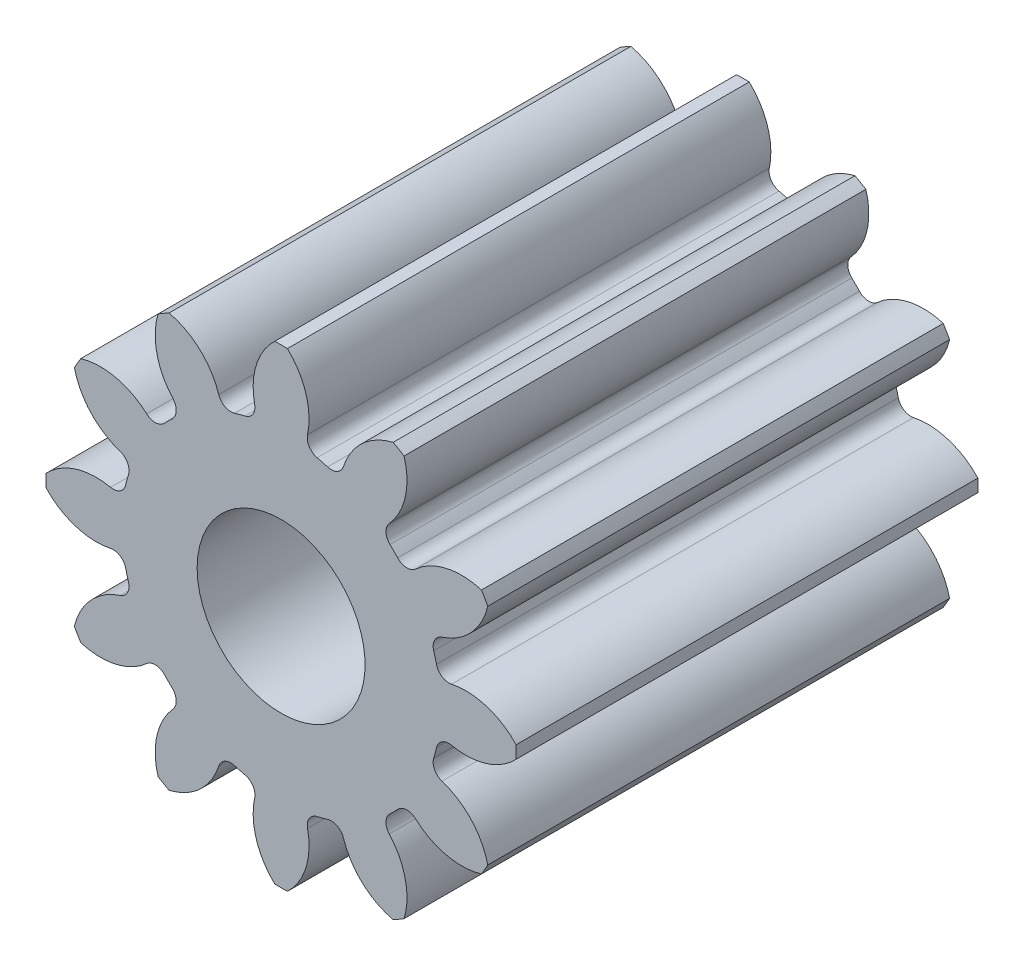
from build123d import *

# Parameters (mm, degrees)
BASE_DENTURE_DEPTH = 5.5
DENTURE_COUNT      = 12
ESQUISSE3_R        = 1
PER_AGE_DEPTH      = 7.77716755


with BuildPart() as part:
    # D_veloppante → Base denture (new body)
    with BuildSketch(Plane.XY):
        with BuildLine():
            Line((0.491756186, 1.83525907), (0, 0))
            Line((0, 0), (-0.491756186, 1.83525907))
            ThreePointArc((-0.491756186, 1.83525907), (-0.460543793, 1.843339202), (-0.429198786, 1.850888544))
            ThreePointArc((-0.429198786, 1.850888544), (-0.335272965, 1.917394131), (-0.31487698, 2.030659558))
            ThreePointArc((-0.31487698, 2.030659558), (-0.295713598, 2.446200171), (-0.075299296, 2.79898732))
            ThreePointArc((-0.075299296, 2.79898732), (0, 2.8), (0.075299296, 2.79898732))
            ThreePointArc((0.075299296, 2.79898732), (0.295713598, 2.446200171), (0.31487698, 2.030659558))
            ThreePointArc((0.31487698, 2.030659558), (0.335272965, 1.917394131), (0.429198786, 1.850888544))
            ThreePointArc((0.429198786, 1.850888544), (0.460543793, 1.843339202), (0.491756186, 1.83525907))
        make_face()
    base_denture = extrude(amount=BASE_DENTURE_DEPTH)

    # Denture: Base denture ×12 about axis
    denture_axis = Axis((0, 0, 0), (0, 0, 1))
    for i in range(1, DENTURE_COUNT):
        add(base_denture.rotate(denture_axis, i * 360 / DENTURE_COUNT))

    # Esquisse3 → Per_age (cut, through all)
    with BuildSketch(Plane.XY):
        Circle(ESQUISSE3_R)
    extrude(amount=PER_AGE_DEPTH, mode=Mode.SUBTRACT)


solid = part.part
